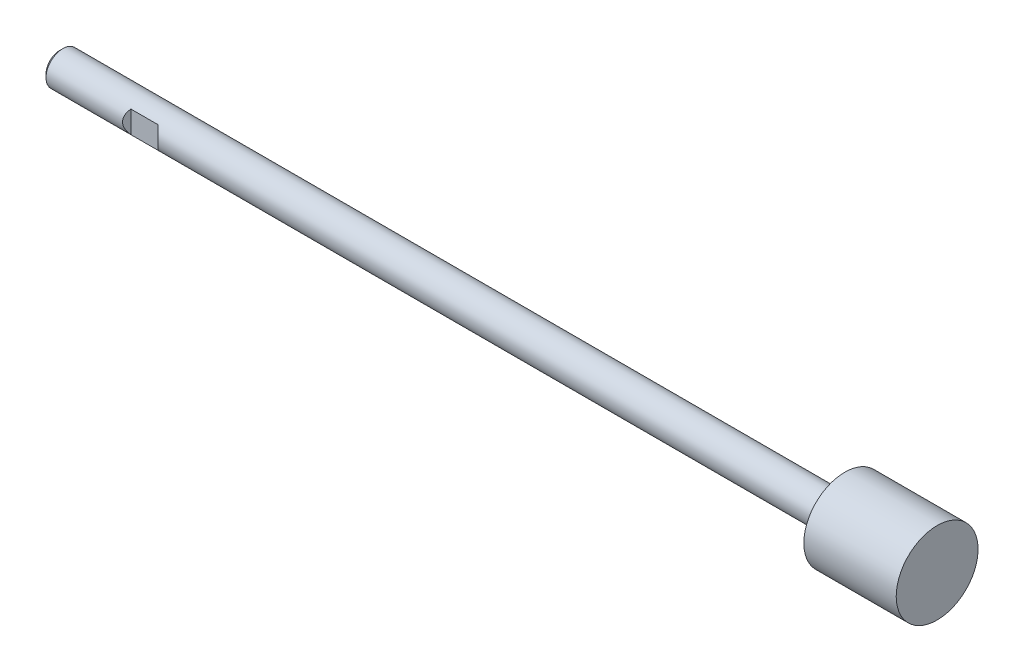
ISO-10303-21;
HEADER;
FILE_DESCRIPTION(('STEP AP214'),'2;1');
FILE_NAME('part.step','',(''),(''),'','','');
FILE_SCHEMA(('AUTOMOTIVE_DESIGN { 1 0 10303 214 1 1 1 1 }'));
ENDSEC;
DATA;
#1=APPLICATION_CONTEXT('core data for automotive mechanical design processes');
#2=APPLICATION_PROTOCOL_DEFINITION('international standard','automotive_design',2000,#1);
#3=PRODUCT_CONTEXT('',#1,'mechanical');
#4=PRODUCT('Part','Part','',(#3));
#5=PRODUCT_RELATED_PRODUCT_CATEGORY('part','',(#4));
#6=PRODUCT_DEFINITION_FORMATION('','',#4);
#7=PRODUCT_DEFINITION_CONTEXT('part definition',#1,'design');
#8=PRODUCT_DEFINITION('design','',#6,#7);
#9=PRODUCT_DEFINITION_SHAPE('','',#8);
#10=(LENGTH_UNIT() NAMED_UNIT(*) SI_UNIT(.MILLI.,.METRE.));
#11=(NAMED_UNIT(*) PLANE_ANGLE_UNIT() SI_UNIT($,.RADIAN.));
#12=(NAMED_UNIT(*) SI_UNIT($,.STERADIAN.) SOLID_ANGLE_UNIT());
#13=UNCERTAINTY_MEASURE_WITH_UNIT(LENGTH_MEASURE(1.E-05),#10,'distance_accuracy_value','');
#14=(GEOMETRIC_REPRESENTATION_CONTEXT(3) GLOBAL_UNCERTAINTY_ASSIGNED_CONTEXT((#13)) GLOBAL_UNIT_ASSIGNED_CONTEXT((#10,
#11,#12)) REPRESENTATION_CONTEXT('',''));
#15=CARTESIAN_POINT('',(0.,0.,0.));
#16=DIRECTION('',(0.,0.,1.));
#17=DIRECTION('',(1.,0.,0.));
#18=AXIS2_PLACEMENT_3D('',#15,#16,#17);
#19=CARTESIAN_POINT('',(0.,0.,0.));
#20=DIRECTION('',(1.,0.,0.));
#21=DIRECTION('',(0.,0.,-1.));
#22=AXIS2_PLACEMENT_3D('',#19,#20,#21);
#23=PLANE('',#22);
#24=CARTESIAN_POINT('',(0.,0.,0.));
#25=DIRECTION('',(-1.,0.,0.));
#26=DIRECTION('',(0.,0.,1.));
#27=AXIS2_PLACEMENT_3D('',#24,#25,#26);
#28=CIRCLE('',#27,3.233);
#29=CARTESIAN_POINT('',(0.,0.,3.233));
#30=VERTEX_POINT('',#29);
#31=EDGE_CURVE('E60',#30,#30,#28,.T.);
#32=ORIENTED_EDGE('',*,*,#31,.T.);
#33=EDGE_LOOP('',(#32));
#34=FACE_BOUND('',#33,.T.);
#35=ADVANCED_FACE('F16',(#34),#23,.F.);
#36=CARTESIAN_POINT('',(0.76699999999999,0.,0.));
#37=DIRECTION('',(1.,0.,0.));
#38=DIRECTION('',(0.,0.,-1.));
#39=AXIS2_PLACEMENT_3D('',#36,#37,#38);
#40=CONICAL_SURFACE('',#39,4.,0.785398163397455);
#41=ORIENTED_EDGE('',*,*,#31,.F.);
#42=EDGE_LOOP('',(#41));
#43=FACE_BOUND('',#42,.T.);
#44=CARTESIAN_POINT('',(0.76699999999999,0.,0.));
#45=DIRECTION('',(-1.,0.,0.));
#46=DIRECTION('',(0.,0.,1.));
#47=AXIS2_PLACEMENT_3D('',#44,#45,#46);
#48=CIRCLE('',#47,4.);
#49=CARTESIAN_POINT('',(0.76699999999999,0.,4.));
#50=VERTEX_POINT('',#49);
#51=EDGE_CURVE('E105',#50,#50,#48,.T.);
#52=ORIENTED_EDGE('',*,*,#51,.T.);
#53=EDGE_LOOP('',(#52));
#54=FACE_BOUND('',#53,.T.);
#55=ADVANCED_FACE('F111',(#43,#54),#40,.T.);
#56=CARTESIAN_POINT('',(209.,0.,0.));
#57=DIRECTION('',(-1.,0.,0.));
#58=DIRECTION('',(0.,0.,1.));
#59=AXIS2_PLACEMENT_3D('',#56,#57,#58);
#60=CYLINDRICAL_SURFACE('',#59,4.);
#61=DIRECTION('',(-1.,0.,0.));
#62=VECTOR('',#61,1.);
#63=CARTESIAN_POINT('',(209.,-2.64575131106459,-3.));
#64=LINE('',#63,#62);
#65=CARTESIAN_POINT('',(20.,-2.64575131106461,-3.));
#66=VERTEX_POINT('',#65);
#67=CARTESIAN_POINT('',(26.4,-2.64575131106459,-3.));
#68=VERTEX_POINT('',#67);
#69=EDGE_CURVE('E81',#66,#68,#64,.F.);
#70=ORIENTED_EDGE('',*,*,#69,.T.);
#71=CARTESIAN_POINT('',(23.4,0.,0.));
#72=DIRECTION('',(0.707106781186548,0.,0.707106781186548));
#73=DIRECTION('',(-0.707106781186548,0.,0.707106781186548));
#74=AXIS2_PLACEMENT_3D('',#71,#72,#73);
#75=ELLIPSE('',#74,5.65685424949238,4.);
#76=CARTESIAN_POINT('',(26.4,2.64575131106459,-3.));
#77=VERTEX_POINT('',#76);
#78=EDGE_CURVE('E11',#68,#77,#75,.T.);
#79=ORIENTED_EDGE('',*,*,#78,.T.);
#80=DIRECTION('',(-1.,0.,0.));
#81=VECTOR('',#80,1.);
#82=CARTESIAN_POINT('',(209.,2.64575131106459,-3.));
#83=LINE('',#82,#81);
#84=CARTESIAN_POINT('',(20.,2.64575131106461,-3.));
#85=VERTEX_POINT('',#84);
#86=EDGE_CURVE('E23',#77,#85,#83,.T.);
#87=ORIENTED_EDGE('',*,*,#86,.T.);
#88=CARTESIAN_POINT('',(23.,0.,0.));
#89=DIRECTION('',(-0.707106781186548,0.,0.707106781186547));
#90=DIRECTION('',(-0.707106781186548,0.,-0.707106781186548));
#91=AXIS2_PLACEMENT_3D('',#88,#89,#90);
#92=ELLIPSE('',#91,5.65685424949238,4.);
#93=EDGE_CURVE('E78',#85,#66,#92,.T.);
#94=ORIENTED_EDGE('',*,*,#93,.T.);
#95=EDGE_LOOP('',(#70,#79,#87,#94));
#96=FACE_BOUND('',#95,.T.);
#97=DIRECTION('',(-1.,0.,0.));
#98=VECTOR('',#97,1.);
#99=CARTESIAN_POINT('',(209.,-2.64575131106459,3.));
#100=LINE('',#99,#98);
#101=CARTESIAN_POINT('',(26.4,-2.64575131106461,3.));
#102=VERTEX_POINT('',#101);
#103=CARTESIAN_POINT('',(20.,-2.64575131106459,3.));
#104=VERTEX_POINT('',#103);
#105=EDGE_CURVE('E66',#102,#104,#100,.T.);
#106=ORIENTED_EDGE('',*,*,#105,.T.);
#107=CARTESIAN_POINT('',(23.,0.,0.));
#108=DIRECTION('',(-0.707106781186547,0.,-0.707106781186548));
#109=DIRECTION('',(-0.707106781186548,0.,0.707106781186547));
#110=AXIS2_PLACEMENT_3D('',#107,#108,#109);
#111=ELLIPSE('',#110,5.65685424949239,4.);
#112=CARTESIAN_POINT('',(20.,2.64575131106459,3.));
#113=VERTEX_POINT('',#112);
#114=EDGE_CURVE('E72',#104,#113,#111,.T.);
#115=ORIENTED_EDGE('',*,*,#114,.T.);
#116=DIRECTION('',(-1.,0.,0.));
#117=VECTOR('',#116,1.);
#118=CARTESIAN_POINT('',(209.,2.64575131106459,3.));
#119=LINE('',#118,#117);
#120=CARTESIAN_POINT('',(26.4,2.6457513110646,3.));
#121=VERTEX_POINT('',#120);
#122=EDGE_CURVE('E59',#113,#121,#119,.F.);
#123=ORIENTED_EDGE('',*,*,#122,.T.);
#124=CARTESIAN_POINT('',(23.4,0.,0.));
#125=DIRECTION('',(0.707106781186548,0.,-0.707106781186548));
#126=DIRECTION('',(-0.707106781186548,0.,-0.707106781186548));
#127=AXIS2_PLACEMENT_3D('',#124,#125,#126);
#128=ELLIPSE('',#127,5.65685424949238,4.);
#129=EDGE_CURVE('E54',#121,#102,#128,.T.);
#130=ORIENTED_EDGE('',*,*,#129,.T.);
#131=EDGE_LOOP('',(#106,#115,#123,#130));
#132=FACE_BOUND('',#131,.T.);
#133=ORIENTED_EDGE('',*,*,#51,.F.);
#134=EDGE_LOOP('',(#133));
#135=FACE_BOUND('',#134,.T.);
#136=CARTESIAN_POINT('',(187.,0.,0.));
#137=DIRECTION('',(-1.,0.,0.));
#138=DIRECTION('',(0.,0.,1.));
#139=AXIS2_PLACEMENT_3D('',#136,#137,#138);
#140=CIRCLE('',#139,4.);
#141=CARTESIAN_POINT('',(187.,0.,4.));
#142=VERTEX_POINT('',#141);
#143=EDGE_CURVE('E102',#142,#142,#140,.T.);
#144=ORIENTED_EDGE('',*,*,#143,.T.);
#145=EDGE_LOOP('',(#144));
#146=FACE_BOUND('',#145,.T.);
#147=ADVANCED_FACE('F70',(#96,#132,#135,#146),#60,.T.);
#148=CARTESIAN_POINT('',(187.,4.,0.));
#149=DIRECTION('',(1.,0.,0.));
#150=DIRECTION('',(0.,0.,-1.));
#151=AXIS2_PLACEMENT_3D('',#148,#149,#150);
#152=PLANE('',#151);
#153=ORIENTED_EDGE('',*,*,#143,.F.);
#154=EDGE_LOOP('',(#153));
#155=FACE_BOUND('',#154,.T.);
#156=CARTESIAN_POINT('',(187.,0.,0.));
#157=DIRECTION('',(-1.,0.,0.));
#158=DIRECTION('',(0.,0.,1.));
#159=AXIS2_PLACEMENT_3D('',#156,#157,#158);
#160=CIRCLE('',#159,9.75);
#161=CARTESIAN_POINT('',(187.,0.,9.75));
#162=VERTEX_POINT('',#161);
#163=EDGE_CURVE('E95',#162,#162,#160,.T.);
#164=ORIENTED_EDGE('',*,*,#163,.T.);
#165=EDGE_LOOP('',(#164));
#166=FACE_BOUND('',#165,.T.);
#167=ADVANCED_FACE('F117',(#155,#166),#152,.F.);
#168=CARTESIAN_POINT('',(209.,0.,0.));
#169=DIRECTION('',(-1.,0.,0.));
#170=DIRECTION('',(0.,0.,1.));
#171=AXIS2_PLACEMENT_3D('',#168,#169,#170);
#172=CYLINDRICAL_SURFACE('',#171,9.75);
#173=ORIENTED_EDGE('',*,*,#163,.F.);
#174=EDGE_LOOP('',(#173));
#175=FACE_BOUND('',#174,.T.);
#176=CARTESIAN_POINT('',(209.,0.,0.));
#177=DIRECTION('',(-1.,0.,0.));
#178=DIRECTION('',(0.,0.,1.));
#179=AXIS2_PLACEMENT_3D('',#176,#177,#178);
#180=CIRCLE('',#179,9.75);
#181=CARTESIAN_POINT('',(209.,0.,9.75));
#182=VERTEX_POINT('',#181);
#183=EDGE_CURVE('E92',#182,#182,#180,.T.);
#184=ORIENTED_EDGE('',*,*,#183,.T.);
#185=EDGE_LOOP('',(#184));
#186=FACE_BOUND('',#185,.T.);
#187=ADVANCED_FACE('F123',(#175,#186),#172,.T.);
#188=CARTESIAN_POINT('',(209.,9.75,0.));
#189=DIRECTION('',(-1.,0.,0.));
#190=DIRECTION('',(0.,0.,1.));
#191=AXIS2_PLACEMENT_3D('',#188,#189,#190);
#192=PLANE('',#191);
#193=ORIENTED_EDGE('',*,*,#183,.F.);
#194=EDGE_LOOP('',(#193));
#195=FACE_BOUND('',#194,.T.);
#196=ADVANCED_FACE('F129',(#195),#192,.F.);
#197=CARTESIAN_POINT('',(35.4,-3.,12.));
#198=DIRECTION('',(0.707106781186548,0.,-0.707106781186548));
#199=DIRECTION('',(-0.707106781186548,0.,-0.707106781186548));
#200=AXIS2_PLACEMENT_3D('',#197,#198,#199);
#201=PLANE('',#200);
#202=DIRECTION('',(0.,1.,0.));
#203=VECTOR('',#202,1.);
#204=CARTESIAN_POINT('',(26.4,-3.,3.));
#205=LINE('',#204,#203);
#206=EDGE_CURVE('E36',#102,#121,#205,.T.);
#207=ORIENTED_EDGE('',*,*,#206,.F.);
#208=ORIENTED_EDGE('',*,*,#129,.F.);
#209=EDGE_LOOP('',(#207,#208));
#210=FACE_BOUND('',#209,.T.);
#211=ADVANCED_FACE('F55',(#210),#201,.F.);
#212=CARTESIAN_POINT('',(26.4,-3.,3.));
#213=DIRECTION('',(0.,0.,-1.));
#214=DIRECTION('',(-1.,0.,0.));
#215=AXIS2_PLACEMENT_3D('',#212,#213,#214);
#216=PLANE('',#215);
#217=ORIENTED_EDGE('',*,*,#206,.T.);
#218=ORIENTED_EDGE('',*,*,#122,.F.);
#219=DIRECTION('',(0.,1.,0.));
#220=VECTOR('',#219,1.);
#221=CARTESIAN_POINT('',(20.,-3.,3.));
#222=LINE('',#221,#220);
#223=EDGE_CURVE('E67',#104,#113,#222,.T.);
#224=ORIENTED_EDGE('',*,*,#223,.F.);
#225=ORIENTED_EDGE('',*,*,#105,.F.);
#226=EDGE_LOOP('',(#217,#218,#224,#225));
#227=FACE_BOUND('',#226,.T.);
#228=ADVANCED_FACE('F63',(#227),#216,.F.);
#229=CARTESIAN_POINT('',(20.,-3.,3.));
#230=DIRECTION('',(-0.707106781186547,0.,-0.707106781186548));
#231=DIRECTION('',(-0.707106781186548,0.,0.707106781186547));
#232=AXIS2_PLACEMENT_3D('',#229,#230,#231);
#233=PLANE('',#232);
#234=ORIENTED_EDGE('',*,*,#223,.T.);
#235=ORIENTED_EDGE('',*,*,#114,.F.);
#236=EDGE_LOOP('',(#234,#235));
#237=FACE_BOUND('',#236,.T.);
#238=ADVANCED_FACE('F194',(#237),#233,.F.);
#239=CARTESIAN_POINT('',(26.4,-3.,-3.));
#240=DIRECTION('',(0.707106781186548,0.,0.707106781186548));
#241=DIRECTION('',(0.707106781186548,0.,-0.707106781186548));
#242=AXIS2_PLACEMENT_3D('',#239,#240,#241);
#243=PLANE('',#242);
#244=DIRECTION('',(0.,1.,0.));
#245=VECTOR('',#244,1.);
#246=CARTESIAN_POINT('',(26.4,-3.,-3.));
#247=LINE('',#246,#245);
#248=EDGE_CURVE('E89',#68,#77,#247,.T.);
#249=ORIENTED_EDGE('',*,*,#248,.T.);
#250=ORIENTED_EDGE('',*,*,#78,.F.);
#251=EDGE_LOOP('',(#249,#250));
#252=FACE_BOUND('',#251,.T.);
#253=ADVANCED_FACE('F91',(#252),#243,.F.);
#254=CARTESIAN_POINT('',(20.,-3.,-3.));
#255=DIRECTION('',(0.,0.,1.));
#256=DIRECTION('',(1.,0.,0.));
#257=AXIS2_PLACEMENT_3D('',#254,#255,#256);
#258=PLANE('',#257);
#259=ORIENTED_EDGE('',*,*,#248,.F.);
#260=ORIENTED_EDGE('',*,*,#69,.F.);
#261=DIRECTION('',(0.,1.,0.));
#262=VECTOR('',#261,1.);
#263=CARTESIAN_POINT('',(20.,-3.,-3.));
#264=LINE('',#263,#262);
#265=EDGE_CURVE('E29',#66,#85,#264,.T.);
#266=ORIENTED_EDGE('',*,*,#265,.T.);
#267=ORIENTED_EDGE('',*,*,#86,.F.);
#268=EDGE_LOOP('',(#259,#260,#266,#267));
#269=FACE_BOUND('',#268,.T.);
#270=ADVANCED_FACE('F88',(#269),#258,.F.);
#271=CARTESIAN_POINT('',(18.,-3.,-5.));
#272=DIRECTION('',(-0.707106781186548,0.,0.707106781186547));
#273=DIRECTION('',(0.707106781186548,0.,0.707106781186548));
#274=AXIS2_PLACEMENT_3D('',#271,#272,#273);
#275=PLANE('',#274);
#276=ORIENTED_EDGE('',*,*,#265,.F.);
#277=ORIENTED_EDGE('',*,*,#93,.F.);
#278=EDGE_LOOP('',(#276,#277));
#279=FACE_BOUND('',#278,.T.);
#280=ADVANCED_FACE('F223',(#279),#275,.F.);
#281=CLOSED_SHELL('',(#35,#55,#147,#167,#187,#196,#211,#228,#238,#253,#270,#280));
#282=MANIFOLD_SOLID_BREP('B1',#281);
#283=ADVANCED_BREP_SHAPE_REPRESENTATION('',(#18,#282),#14);
#284=SHAPE_DEFINITION_REPRESENTATION(#9,#283);
ENDSEC;
END-ISO-10303-21;
